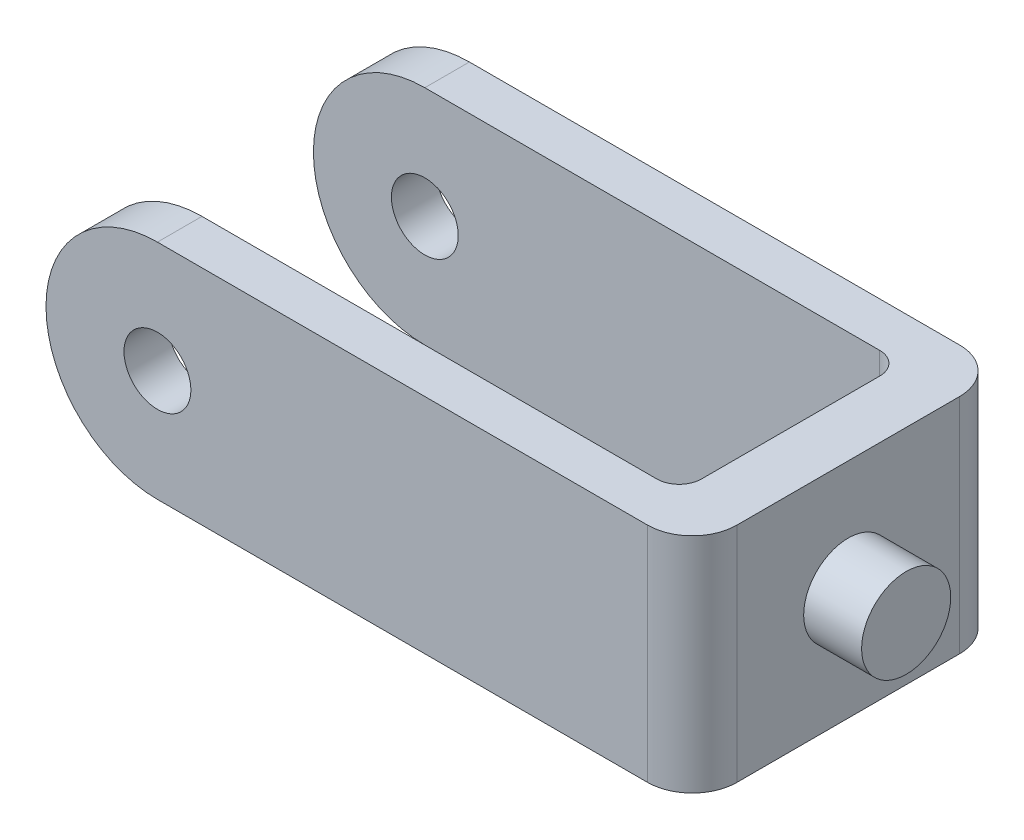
ISO-10303-21;
HEADER;
FILE_DESCRIPTION(('STEP AP214'),'2;1');
FILE_NAME('part.step','',(''),(''),'','','');
FILE_SCHEMA(('AUTOMOTIVE_DESIGN { 1 0 10303 214 1 1 1 1 }'));
ENDSEC;
DATA;
#1=APPLICATION_CONTEXT('core data for automotive mechanical design processes');
#2=APPLICATION_PROTOCOL_DEFINITION('international standard','automotive_design',2000,#1);
#3=PRODUCT_CONTEXT('',#1,'mechanical');
#4=PRODUCT('Part','Part','',(#3));
#5=PRODUCT_RELATED_PRODUCT_CATEGORY('part','',(#4));
#6=PRODUCT_DEFINITION_FORMATION('','',#4);
#7=PRODUCT_DEFINITION_CONTEXT('part definition',#1,'design');
#8=PRODUCT_DEFINITION('design','',#6,#7);
#9=PRODUCT_DEFINITION_SHAPE('','',#8);
#10=(LENGTH_UNIT() NAMED_UNIT(*) SI_UNIT(.MILLI.,.METRE.));
#11=(NAMED_UNIT(*) PLANE_ANGLE_UNIT() SI_UNIT($,.RADIAN.));
#12=(NAMED_UNIT(*) SI_UNIT($,.STERADIAN.) SOLID_ANGLE_UNIT());
#13=UNCERTAINTY_MEASURE_WITH_UNIT(LENGTH_MEASURE(1.E-05),#10,'distance_accuracy_value','');
#14=(GEOMETRIC_REPRESENTATION_CONTEXT(3) GLOBAL_UNCERTAINTY_ASSIGNED_CONTEXT((#13)) GLOBAL_UNIT_ASSIGNED_CONTEXT((#10,
#11,#12)) REPRESENTATION_CONTEXT('',''));
#15=CARTESIAN_POINT('',(0.,0.,0.));
#16=DIRECTION('',(0.,0.,1.));
#17=DIRECTION('',(1.,0.,0.));
#18=AXIS2_PLACEMENT_3D('',#15,#16,#17);
#19=CARTESIAN_POINT('',(74.8577111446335,50.,-40.));
#20=DIRECTION('',(-1.,0.,0.));
#21=DIRECTION('',(0.,0.,1.));
#22=AXIS2_PLACEMENT_3D('',#19,#20,#21);
#23=PLANE('',#22);
#24=DIRECTION('',(0.,0.,-1.));
#25=VECTOR('',#24,1.);
#26=CARTESIAN_POINT('',(74.8577111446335,50.,-40.));
#27=LINE('',#26,#25);
#28=CARTESIAN_POINT('',(74.8577111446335,50.,20.));
#29=VERTEX_POINT('',#28);
#30=CARTESIAN_POINT('',(74.8577111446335,50.,-30.));
#31=VERTEX_POINT('',#30);
#32=EDGE_CURVE('E172',#29,#31,#27,.T.);
#33=ORIENTED_EDGE('',*,*,#32,.F.);
#34=DIRECTION('',(0.,-1.,0.));
#35=VECTOR('',#34,1.);
#36=CARTESIAN_POINT('',(74.8577111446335,50.,20.));
#37=LINE('',#36,#35);
#38=CARTESIAN_POINT('',(74.8577111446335,0.,20.));
#39=VERTEX_POINT('',#38);
#40=EDGE_CURVE('E191',#29,#39,#37,.T.);
#41=ORIENTED_EDGE('',*,*,#40,.T.);
#42=DIRECTION('',(0.,0.,-1.));
#43=VECTOR('',#42,1.);
#44=CARTESIAN_POINT('',(74.8577111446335,0.,-40.));
#45=LINE('',#44,#43);
#46=CARTESIAN_POINT('',(74.8577111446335,0.,-30.));
#47=VERTEX_POINT('',#46);
#48=EDGE_CURVE('E130',#39,#47,#45,.T.);
#49=ORIENTED_EDGE('',*,*,#48,.T.);
#50=DIRECTION('',(0.,-1.,0.));
#51=VECTOR('',#50,1.);
#52=CARTESIAN_POINT('',(74.8577111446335,50.,-30.));
#53=LINE('',#52,#51);
#54=EDGE_CURVE('E177',#47,#31,#53,.F.);
#55=ORIENTED_EDGE('',*,*,#54,.T.);
#56=EDGE_LOOP('',(#33,#41,#49,#55));
#57=FACE_BOUND('',#56,.T.);
#58=CARTESIAN_POINT('',(74.8577111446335,25.,-5.00000000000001));
#59=DIRECTION('',(-1.,0.,0.));
#60=DIRECTION('',(0.,0.,1.));
#61=AXIS2_PLACEMENT_3D('',#58,#59,#60);
#62=CIRCLE('',#61,10.);
#63=CARTESIAN_POINT('',(74.8577111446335,25.,5.));
#64=VERTEX_POINT('',#63);
#65=EDGE_CURVE('E206',#64,#64,#62,.F.);
#66=ORIENTED_EDGE('',*,*,#65,.F.);
#67=EDGE_LOOP('',(#66));
#68=FACE_BOUND('',#67,.T.);
#69=ADVANCED_FACE('F31',(#57,#68),#23,.F.);
#70=CARTESIAN_POINT('',(61.9247651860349,50.,-30.));
#71=DIRECTION('',(0.,0.,-1.));
#72=DIRECTION('',(-1.,0.,0.));
#73=AXIS2_PLACEMENT_3D('',#70,#71,#72);
#74=PLANE('',#73);
#75=CARTESIAN_POINT('',(-45.1422888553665,25.,-30.));
#76=DIRECTION('',(0.,0.,-1.));
#77=DIRECTION('',(-1.,0.,0.));
#78=AXIS2_PLACEMENT_3D('',#75,#76,#77);
#79=CIRCLE('',#78,7.5);
#80=CARTESIAN_POINT('',(-52.6422888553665,25.,-30.));
#81=VERTEX_POINT('',#80);
#82=EDGE_CURVE('E150',#81,#81,#79,.T.);
#83=ORIENTED_EDGE('',*,*,#82,.T.);
#84=EDGE_LOOP('',(#83));
#85=FACE_BOUND('',#84,.T.);
#86=DIRECTION('',(1.,0.,0.));
#87=VECTOR('',#86,1.);
#88=CARTESIAN_POINT('',(61.9247651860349,0.,-30.));
#89=LINE('',#88,#87);
#90=CARTESIAN_POINT('',(-45.1422888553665,0.,-30.));
#91=VERTEX_POINT('',#90);
#92=CARTESIAN_POINT('',(56.9247651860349,0.,-30.));
#93=VERTEX_POINT('',#92);
#94=EDGE_CURVE('E180',#91,#93,#89,.T.);
#95=ORIENTED_EDGE('',*,*,#94,.T.);
#96=DIRECTION('',(0.,-1.,0.));
#97=VECTOR('',#96,1.);
#98=CARTESIAN_POINT('',(56.9247651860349,50.,-30.));
#99=LINE('',#98,#97);
#100=CARTESIAN_POINT('',(56.9247651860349,50.,-30.));
#101=VERTEX_POINT('',#100);
#102=EDGE_CURVE('E214',#93,#101,#99,.F.);
#103=ORIENTED_EDGE('',*,*,#102,.T.);
#104=DIRECTION('',(1.,0.,0.));
#105=VECTOR('',#104,1.);
#106=CARTESIAN_POINT('',(61.9247651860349,50.,-30.));
#107=LINE('',#106,#105);
#108=CARTESIAN_POINT('',(-45.1422888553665,50.,-30.));
#109=VERTEX_POINT('',#108);
#110=EDGE_CURVE('E161',#109,#101,#107,.T.);
#111=ORIENTED_EDGE('',*,*,#110,.F.);
#112=CARTESIAN_POINT('',(-45.1422888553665,25.,-30.));
#113=DIRECTION('',(0.,0.,-1.));
#114=DIRECTION('',(-1.,0.,0.));
#115=AXIS2_PLACEMENT_3D('',#112,#113,#114);
#116=CIRCLE('',#115,25.);
#117=EDGE_CURVE('E148',#91,#109,#116,.T.);
#118=ORIENTED_EDGE('',*,*,#117,.F.);
#119=EDGE_LOOP('',(#95,#103,#111,#118));
#120=FACE_BOUND('',#119,.T.);
#121=ADVANCED_FACE('F252',(#85,#120),#74,.F.);
#122=CARTESIAN_POINT('',(61.9247651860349,50.,-30.));
#123=DIRECTION('',(1.,0.,0.));
#124=DIRECTION('',(0.,0.,-1.));
#125=AXIS2_PLACEMENT_3D('',#122,#123,#124);
#126=PLANE('',#125);
#127=DIRECTION('',(0.,0.,1.));
#128=VECTOR('',#127,1.);
#129=CARTESIAN_POINT('',(61.9247651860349,50.,-30.));
#130=LINE('',#129,#128);
#131=CARTESIAN_POINT('',(61.9247651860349,50.,-25.));
#132=VERTEX_POINT('',#131);
#133=CARTESIAN_POINT('',(61.9247651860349,50.,15.));
#134=VERTEX_POINT('',#133);
#135=EDGE_CURVE('E165',#132,#134,#130,.T.);
#136=ORIENTED_EDGE('',*,*,#135,.F.);
#137=DIRECTION('',(0.,-1.,0.));
#138=VECTOR('',#137,1.);
#139=CARTESIAN_POINT('',(61.9247651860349,0.,-25.));
#140=LINE('',#139,#138);
#141=CARTESIAN_POINT('',(61.9247651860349,0.,-25.));
#142=VERTEX_POINT('',#141);
#143=EDGE_CURVE('E211',#132,#142,#140,.T.);
#144=ORIENTED_EDGE('',*,*,#143,.T.);
#145=DIRECTION('',(0.,0.,1.));
#146=VECTOR('',#145,1.);
#147=CARTESIAN_POINT('',(61.9247651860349,0.,-30.));
#148=LINE('',#147,#146);
#149=CARTESIAN_POINT('',(61.9247651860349,0.,15.));
#150=VERTEX_POINT('',#149);
#151=EDGE_CURVE('E183',#142,#150,#148,.T.);
#152=ORIENTED_EDGE('',*,*,#151,.T.);
#153=DIRECTION('',(0.,-1.,0.));
#154=VECTOR('',#153,1.);
#155=CARTESIAN_POINT('',(61.9247651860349,50.,15.));
#156=LINE('',#155,#154);
#157=EDGE_CURVE('E209',#150,#134,#156,.F.);
#158=ORIENTED_EDGE('',*,*,#157,.T.);
#159=EDGE_LOOP('',(#136,#144,#152,#158));
#160=FACE_BOUND('',#159,.T.);
#161=ADVANCED_FACE('F224',(#160),#126,.F.);
#162=CARTESIAN_POINT('',(61.9247651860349,50.,20.));
#163=DIRECTION('',(0.,0.,1.));
#164=DIRECTION('',(1.,0.,0.));
#165=AXIS2_PLACEMENT_3D('',#162,#163,#164);
#166=PLANE('',#165);
#167=CARTESIAN_POINT('',(-45.1422888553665,25.,20.));
#168=DIRECTION('',(0.,0.,1.));
#169=DIRECTION('',(1.,0.,0.));
#170=AXIS2_PLACEMENT_3D('',#167,#168,#169);
#171=CIRCLE('',#170,7.5);
#172=CARTESIAN_POINT('',(-37.6422888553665,25.,20.));
#173=VERTEX_POINT('',#172);
#174=EDGE_CURVE('E434',#173,#173,#171,.T.);
#175=ORIENTED_EDGE('',*,*,#174,.T.);
#176=EDGE_LOOP('',(#175));
#177=FACE_BOUND('',#176,.T.);
#178=DIRECTION('',(-1.,0.,0.));
#179=VECTOR('',#178,1.);
#180=CARTESIAN_POINT('',(61.9247651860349,50.,20.));
#181=LINE('',#180,#179);
#182=CARTESIAN_POINT('',(56.9247651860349,50.,20.));
#183=VERTEX_POINT('',#182);
#184=CARTESIAN_POINT('',(-45.1422888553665,50.,20.));
#185=VERTEX_POINT('',#184);
#186=EDGE_CURVE('E167',#183,#185,#181,.T.);
#187=ORIENTED_EDGE('',*,*,#186,.F.);
#188=DIRECTION('',(0.,-1.,0.));
#189=VECTOR('',#188,1.);
#190=CARTESIAN_POINT('',(56.9247651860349,0.,20.));
#191=LINE('',#190,#189);
#192=CARTESIAN_POINT('',(56.9247651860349,0.,20.));
#193=VERTEX_POINT('',#192);
#194=EDGE_CURVE('E216',#183,#193,#191,.T.);
#195=ORIENTED_EDGE('',*,*,#194,.T.);
#196=DIRECTION('',(-1.,0.,0.));
#197=VECTOR('',#196,1.);
#198=CARTESIAN_POINT('',(61.9247651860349,0.,20.));
#199=LINE('',#198,#197);
#200=CARTESIAN_POINT('',(-45.1422888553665,0.,20.));
#201=VERTEX_POINT('',#200);
#202=EDGE_CURVE('E139',#193,#201,#199,.T.);
#203=ORIENTED_EDGE('',*,*,#202,.T.);
#204=CARTESIAN_POINT('',(-45.1422888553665,25.,20.));
#205=DIRECTION('',(0.,0.,-1.));
#206=DIRECTION('',(-1.,0.,0.));
#207=AXIS2_PLACEMENT_3D('',#204,#205,#206);
#208=CIRCLE('',#207,25.);
#209=EDGE_CURVE('E138',#201,#185,#208,.T.);
#210=ORIENTED_EDGE('',*,*,#209,.T.);
#211=EDGE_LOOP('',(#187,#195,#203,#210));
#212=FACE_BOUND('',#211,.T.);
#213=ADVANCED_FACE('F227',(#177,#212),#166,.F.);
#214=CARTESIAN_POINT('',(-45.1422888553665,50.,30.));
#215=DIRECTION('',(0.,0.,-1.));
#216=DIRECTION('',(-1.,0.,0.));
#217=AXIS2_PLACEMENT_3D('',#214,#215,#216);
#218=PLANE('',#217);
#219=CARTESIAN_POINT('',(-45.1422888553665,25.,30.));
#220=DIRECTION('',(0.,0.,-1.));
#221=DIRECTION('',(-1.,0.,0.));
#222=AXIS2_PLACEMENT_3D('',#219,#220,#221);
#223=CIRCLE('',#222,7.5);
#224=CARTESIAN_POINT('',(-52.6422888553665,25.,30.));
#225=VERTEX_POINT('',#224);
#226=EDGE_CURVE('E430',#225,#225,#223,.T.);
#227=ORIENTED_EDGE('',*,*,#226,.T.);
#228=EDGE_LOOP('',(#227));
#229=FACE_BOUND('',#228,.T.);
#230=DIRECTION('',(1.,0.,0.));
#231=VECTOR('',#230,1.);
#232=CARTESIAN_POINT('',(-45.1422888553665,50.,30.));
#233=LINE('',#232,#231);
#234=CARTESIAN_POINT('',(-45.1422888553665,50.,30.));
#235=VERTEX_POINT('',#234);
#236=CARTESIAN_POINT('',(64.8577111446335,50.,30.));
#237=VERTEX_POINT('',#236);
#238=EDGE_CURVE('E144',#235,#237,#233,.T.);
#239=ORIENTED_EDGE('',*,*,#238,.F.);
#240=CARTESIAN_POINT('',(-45.1422888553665,25.,30.));
#241=DIRECTION('',(0.,0.,-1.));
#242=DIRECTION('',(-1.,0.,0.));
#243=AXIS2_PLACEMENT_3D('',#240,#241,#242);
#244=CIRCLE('',#243,25.);
#245=CARTESIAN_POINT('',(-45.1422888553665,0.,30.));
#246=VERTEX_POINT('',#245);
#247=EDGE_CURVE('E136',#246,#235,#244,.T.);
#248=ORIENTED_EDGE('',*,*,#247,.F.);
#249=DIRECTION('',(1.,0.,0.));
#250=VECTOR('',#249,1.);
#251=CARTESIAN_POINT('',(-45.1422888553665,0.,30.));
#252=LINE('',#251,#250);
#253=CARTESIAN_POINT('',(64.8577111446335,0.,30.));
#254=VERTEX_POINT('',#253);
#255=EDGE_CURVE('E119',#246,#254,#252,.T.);
#256=ORIENTED_EDGE('',*,*,#255,.T.);
#257=DIRECTION('',(0.,-1.,0.));
#258=VECTOR('',#257,1.);
#259=CARTESIAN_POINT('',(64.8577111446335,50.,30.));
#260=LINE('',#259,#258);
#261=EDGE_CURVE('E197',#254,#237,#260,.F.);
#262=ORIENTED_EDGE('',*,*,#261,.T.);
#263=EDGE_LOOP('',(#239,#248,#256,#262));
#264=FACE_BOUND('',#263,.T.);
#265=ADVANCED_FACE('F142',(#229,#264),#218,.F.);
#266=CARTESIAN_POINT('',(-45.1422888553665,50.,-40.));
#267=DIRECTION('',(0.,0.,1.));
#268=DIRECTION('',(1.,0.,0.));
#269=AXIS2_PLACEMENT_3D('',#266,#267,#268);
#270=PLANE('',#269);
#271=CARTESIAN_POINT('',(-45.1422888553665,25.,-40.));
#272=DIRECTION('',(0.,0.,-1.));
#273=DIRECTION('',(-1.,0.,0.));
#274=AXIS2_PLACEMENT_3D('',#271,#272,#273);
#275=CIRCLE('',#274,7.5);
#276=CARTESIAN_POINT('',(-52.6422888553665,25.,-40.));
#277=VERTEX_POINT('',#276);
#278=EDGE_CURVE('E427',#277,#277,#275,.T.);
#279=ORIENTED_EDGE('',*,*,#278,.F.);
#280=EDGE_LOOP('',(#279));
#281=FACE_BOUND('',#280,.T.);
#282=DIRECTION('',(-1.,0.,0.));
#283=VECTOR('',#282,1.);
#284=CARTESIAN_POINT('',(-45.1422888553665,0.,-40.));
#285=LINE('',#284,#283);
#286=CARTESIAN_POINT('',(64.8577111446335,0.,-40.));
#287=VERTEX_POINT('',#286);
#288=CARTESIAN_POINT('',(-45.1422888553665,0.,-40.));
#289=VERTEX_POINT('',#288);
#290=EDGE_CURVE('E162',#287,#289,#285,.T.);
#291=ORIENTED_EDGE('',*,*,#290,.T.);
#292=CARTESIAN_POINT('',(-45.1422888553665,25.,-40.));
#293=DIRECTION('',(0.,0.,-1.));
#294=DIRECTION('',(-1.,0.,0.));
#295=AXIS2_PLACEMENT_3D('',#292,#293,#294);
#296=CIRCLE('',#295,25.);
#297=CARTESIAN_POINT('',(-45.1422888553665,50.,-40.));
#298=VERTEX_POINT('',#297);
#299=EDGE_CURVE('E145',#289,#298,#296,.T.);
#300=ORIENTED_EDGE('',*,*,#299,.T.);
#301=DIRECTION('',(-1.,0.,0.));
#302=VECTOR('',#301,1.);
#303=CARTESIAN_POINT('',(-45.1422888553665,50.,-40.));
#304=LINE('',#303,#302);
#305=CARTESIAN_POINT('',(64.8577111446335,50.,-40.));
#306=VERTEX_POINT('',#305);
#307=EDGE_CURVE('E175',#306,#298,#304,.T.);
#308=ORIENTED_EDGE('',*,*,#307,.F.);
#309=DIRECTION('',(0.,-1.,0.));
#310=VECTOR('',#309,1.);
#311=CARTESIAN_POINT('',(64.8577111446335,50.,-40.));
#312=LINE('',#311,#310);
#313=EDGE_CURVE('E203',#306,#287,#312,.T.);
#314=ORIENTED_EDGE('',*,*,#313,.T.);
#315=EDGE_LOOP('',(#291,#300,#308,#314));
#316=FACE_BOUND('',#315,.T.);
#317=ADVANCED_FACE('F245',(#281,#316),#270,.F.);
#318=CARTESIAN_POINT('',(-45.1422888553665,50.,-30.));
#319=DIRECTION('',(0.,-1.,0.));
#320=DIRECTION('',(0.,0.,-1.));
#321=AXIS2_PLACEMENT_3D('',#318,#319,#320);
#322=PLANE('',#321);
#323=ORIENTED_EDGE('',*,*,#238,.T.);
#324=CARTESIAN_POINT('',(64.8577111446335,50.,20.));
#325=DIRECTION('',(0.,-1.,0.));
#326=DIRECTION('',(0.,0.,-1.));
#327=AXIS2_PLACEMENT_3D('',#324,#325,#326);
#328=CIRCLE('',#327,10.);
#329=EDGE_CURVE('E201',#237,#29,#328,.F.);
#330=ORIENTED_EDGE('',*,*,#329,.T.);
#331=ORIENTED_EDGE('',*,*,#32,.T.);
#332=CARTESIAN_POINT('',(64.8577111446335,50.,-30.));
#333=DIRECTION('',(0.,-1.,0.));
#334=DIRECTION('',(0.,0.,-1.));
#335=AXIS2_PLACEMENT_3D('',#332,#333,#334);
#336=CIRCLE('',#335,10.);
#337=EDGE_CURVE('E199',#31,#306,#336,.F.);
#338=ORIENTED_EDGE('',*,*,#337,.T.);
#339=ORIENTED_EDGE('',*,*,#307,.T.);
#340=DIRECTION('',(0.,0.,1.));
#341=VECTOR('',#340,1.);
#342=CARTESIAN_POINT('',(-45.1422888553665,50.,-40.));
#343=LINE('',#342,#341);
#344=EDGE_CURVE('E158',#298,#109,#343,.T.);
#345=ORIENTED_EDGE('',*,*,#344,.T.);
#346=ORIENTED_EDGE('',*,*,#110,.T.);
#347=CARTESIAN_POINT('',(56.9247651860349,50.,-25.));
#348=DIRECTION('',(0.,-1.,0.));
#349=DIRECTION('',(0.,0.,-1.));
#350=AXIS2_PLACEMENT_3D('',#347,#348,#349);
#351=CIRCLE('',#350,5.);
#352=EDGE_CURVE('E220',#101,#132,#351,.T.);
#353=ORIENTED_EDGE('',*,*,#352,.T.);
#354=ORIENTED_EDGE('',*,*,#135,.T.);
#355=CARTESIAN_POINT('',(56.9247651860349,50.,15.));
#356=DIRECTION('',(0.,-1.,0.));
#357=DIRECTION('',(0.,0.,-1.));
#358=AXIS2_PLACEMENT_3D('',#355,#356,#357);
#359=CIRCLE('',#358,5.);
#360=EDGE_CURVE('E11',#134,#183,#359,.T.);
#361=ORIENTED_EDGE('',*,*,#360,.T.);
#362=ORIENTED_EDGE('',*,*,#186,.T.);
#363=DIRECTION('',(0.,0.,1.));
#364=VECTOR('',#363,1.);
#365=CARTESIAN_POINT('',(-45.1422888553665,50.,20.));
#366=LINE('',#365,#364);
#367=EDGE_CURVE('E169',#185,#235,#366,.T.);
#368=ORIENTED_EDGE('',*,*,#367,.T.);
#369=EDGE_LOOP('',(#323,#330,#331,#338,#339,#345,#346,#353,#354,#361,#362,#368));
#370=FACE_BOUND('',#369,.T.);
#371=ADVANCED_FACE('F228',(#370),#322,.F.);
#372=CARTESIAN_POINT('',(-45.1422888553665,0.,-30.));
#373=DIRECTION('',(0.,-1.,0.));
#374=DIRECTION('',(0.,0.,-1.));
#375=AXIS2_PLACEMENT_3D('',#372,#373,#374);
#376=PLANE('',#375);
#377=ORIENTED_EDGE('',*,*,#48,.F.);
#378=CARTESIAN_POINT('',(64.8577111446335,0.,20.));
#379=DIRECTION('',(0.,-1.,0.));
#380=DIRECTION('',(0.,0.,-1.));
#381=AXIS2_PLACEMENT_3D('',#378,#379,#380);
#382=CIRCLE('',#381,10.);
#383=EDGE_CURVE('E126',#39,#254,#382,.T.);
#384=ORIENTED_EDGE('',*,*,#383,.T.);
#385=ORIENTED_EDGE('',*,*,#255,.F.);
#386=DIRECTION('',(0.,0.,1.));
#387=VECTOR('',#386,1.);
#388=CARTESIAN_POINT('',(-45.1422888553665,0.,20.));
#389=LINE('',#388,#387);
#390=EDGE_CURVE('E124',#201,#246,#389,.T.);
#391=ORIENTED_EDGE('',*,*,#390,.F.);
#392=ORIENTED_EDGE('',*,*,#202,.F.);
#393=CARTESIAN_POINT('',(56.9247651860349,0.,15.));
#394=DIRECTION('',(0.,-1.,0.));
#395=DIRECTION('',(0.,0.,-1.));
#396=AXIS2_PLACEMENT_3D('',#393,#394,#395);
#397=CIRCLE('',#396,5.);
#398=EDGE_CURVE('E39',#193,#150,#397,.F.);
#399=ORIENTED_EDGE('',*,*,#398,.T.);
#400=ORIENTED_EDGE('',*,*,#151,.F.);
#401=CARTESIAN_POINT('',(56.9247651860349,0.,-25.));
#402=DIRECTION('',(0.,-1.,0.));
#403=DIRECTION('',(0.,0.,-1.));
#404=AXIS2_PLACEMENT_3D('',#401,#402,#403);
#405=CIRCLE('',#404,5.);
#406=EDGE_CURVE('E218',#142,#93,#405,.F.);
#407=ORIENTED_EDGE('',*,*,#406,.T.);
#408=ORIENTED_EDGE('',*,*,#94,.F.);
#409=DIRECTION('',(0.,0.,1.));
#410=VECTOR('',#409,1.);
#411=CARTESIAN_POINT('',(-45.1422888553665,0.,-40.));
#412=LINE('',#411,#410);
#413=EDGE_CURVE('E156',#289,#91,#412,.T.);
#414=ORIENTED_EDGE('',*,*,#413,.F.);
#415=ORIENTED_EDGE('',*,*,#290,.F.);
#416=CARTESIAN_POINT('',(64.8577111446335,0.,-30.));
#417=DIRECTION('',(0.,-1.,0.));
#418=DIRECTION('',(0.,0.,-1.));
#419=AXIS2_PLACEMENT_3D('',#416,#417,#418);
#420=CIRCLE('',#419,10.);
#421=EDGE_CURVE('E194',#287,#47,#420,.T.);
#422=ORIENTED_EDGE('',*,*,#421,.T.);
#423=EDGE_LOOP('',(#377,#384,#385,#391,#392,#399,#400,#407,#408,#414,#415,#422));
#424=FACE_BOUND('',#423,.T.);
#425=ADVANCED_FACE('F122',(#424),#376,.T.);
#426=CARTESIAN_POINT('',(64.8577111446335,50.,20.));
#427=DIRECTION('',(0.,-1.,0.));
#428=DIRECTION('',(0.,0.,-1.));
#429=AXIS2_PLACEMENT_3D('',#426,#427,#428);
#430=CYLINDRICAL_SURFACE('',#429,10.);
#431=ORIENTED_EDGE('',*,*,#329,.F.);
#432=ORIENTED_EDGE('',*,*,#261,.F.);
#433=ORIENTED_EDGE('',*,*,#383,.F.);
#434=ORIENTED_EDGE('',*,*,#40,.F.);
#435=EDGE_LOOP('',(#431,#432,#433,#434));
#436=FACE_BOUND('',#435,.T.);
#437=ADVANCED_FACE('F233',(#436),#430,.T.);
#438=CARTESIAN_POINT('',(64.8577111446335,50.,-30.));
#439=DIRECTION('',(0.,-1.,0.));
#440=DIRECTION('',(0.,0.,-1.));
#441=AXIS2_PLACEMENT_3D('',#438,#439,#440);
#442=CYLINDRICAL_SURFACE('',#441,10.);
#443=ORIENTED_EDGE('',*,*,#337,.F.);
#444=ORIENTED_EDGE('',*,*,#54,.F.);
#445=ORIENTED_EDGE('',*,*,#421,.F.);
#446=ORIENTED_EDGE('',*,*,#313,.F.);
#447=EDGE_LOOP('',(#443,#444,#445,#446));
#448=FACE_BOUND('',#447,.T.);
#449=ADVANCED_FACE('F242',(#448),#442,.T.);
#450=CARTESIAN_POINT('',(-45.1422888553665,25.,-30.));
#451=DIRECTION('',(0.,0.,-1.));
#452=DIRECTION('',(-1.,0.,0.));
#453=AXIS2_PLACEMENT_3D('',#450,#451,#452);
#454=CYLINDRICAL_SURFACE('',#453,25.);
#455=ORIENTED_EDGE('',*,*,#117,.T.);
#456=ORIENTED_EDGE('',*,*,#344,.F.);
#457=ORIENTED_EDGE('',*,*,#299,.F.);
#458=ORIENTED_EDGE('',*,*,#413,.T.);
#459=EDGE_LOOP('',(#455,#456,#457,#458));
#460=FACE_BOUND('',#459,.T.);
#461=ADVANCED_FACE('F249',(#460),#454,.T.);
#462=CARTESIAN_POINT('',(-45.1422888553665,25.,30.));
#463=DIRECTION('',(0.,0.,-1.));
#464=DIRECTION('',(-1.,0.,0.));
#465=AXIS2_PLACEMENT_3D('',#462,#463,#464);
#466=CYLINDRICAL_SURFACE('',#465,25.);
#467=ORIENTED_EDGE('',*,*,#247,.T.);
#468=ORIENTED_EDGE('',*,*,#367,.F.);
#469=ORIENTED_EDGE('',*,*,#209,.F.);
#470=ORIENTED_EDGE('',*,*,#390,.T.);
#471=EDGE_LOOP('',(#467,#468,#469,#470));
#472=FACE_BOUND('',#471,.T.);
#473=ADVANCED_FACE('F134',(#472),#466,.T.);
#474=CARTESIAN_POINT('',(-45.1422888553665,25.,30.));
#475=DIRECTION('',(0.,0.,-1.));
#476=DIRECTION('',(-1.,0.,0.));
#477=AXIS2_PLACEMENT_3D('',#474,#475,#476);
#478=CYLINDRICAL_SURFACE('',#477,7.5);
#479=ORIENTED_EDGE('',*,*,#278,.T.);
#480=EDGE_LOOP('',(#479));
#481=FACE_BOUND('',#480,.T.);
#482=ORIENTED_EDGE('',*,*,#82,.F.);
#483=EDGE_LOOP('',(#482));
#484=FACE_BOUND('',#483,.T.);
#485=ADVANCED_FACE('F294',(#481,#484),#478,.F.);
#486=ORIENTED_EDGE('',*,*,#226,.F.);
#487=EDGE_LOOP('',(#486));
#488=FACE_BOUND('',#487,.T.);
#489=ORIENTED_EDGE('',*,*,#174,.F.);
#490=EDGE_LOOP('',(#489));
#491=FACE_BOUND('',#490,.T.);
#492=ADVANCED_FACE('F349',(#488,#491),#478,.F.);
#493=CARTESIAN_POINT('',(87.8577111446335,25.,-5.00000000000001));
#494=DIRECTION('',(-1.,0.,0.));
#495=DIRECTION('',(0.,0.,1.));
#496=AXIS2_PLACEMENT_3D('',#493,#494,#495);
#497=CYLINDRICAL_SURFACE('',#496,10.);
#498=CARTESIAN_POINT('',(87.8577111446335,25.,-5.00000000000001));
#499=DIRECTION('',(1.,0.,0.));
#500=DIRECTION('',(0.,0.,-1.));
#501=AXIS2_PLACEMENT_3D('',#498,#499,#500);
#502=CIRCLE('',#501,10.);
#503=CARTESIAN_POINT('',(87.8577111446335,25.,-15.));
#504=VERTEX_POINT('',#503);
#505=EDGE_CURVE('E425',#504,#504,#502,.T.);
#506=ORIENTED_EDGE('',*,*,#505,.F.);
#507=EDGE_LOOP('',(#506));
#508=FACE_BOUND('',#507,.T.);
#509=ORIENTED_EDGE('',*,*,#65,.T.);
#510=EDGE_LOOP('',(#509));
#511=FACE_BOUND('',#510,.T.);
#512=ADVANCED_FACE('F263',(#508,#511),#497,.T.);
#513=CARTESIAN_POINT('',(87.8577111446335,25.,-5.00000000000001));
#514=DIRECTION('',(1.,0.,0.));
#515=DIRECTION('',(0.,0.,-1.));
#516=AXIS2_PLACEMENT_3D('',#513,#514,#515);
#517=PLANE('',#516);
#518=ORIENTED_EDGE('',*,*,#505,.T.);
#519=EDGE_LOOP('',(#518));
#520=FACE_BOUND('',#519,.T.);
#521=ADVANCED_FACE('F258',(#520),#517,.T.);
#522=CARTESIAN_POINT('',(56.9247651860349,50.,-25.));
#523=DIRECTION('',(0.,1.,0.));
#524=DIRECTION('',(0.,0.,1.));
#525=AXIS2_PLACEMENT_3D('',#522,#523,#524);
#526=CYLINDRICAL_SURFACE('',#525,5.);
#527=ORIENTED_EDGE('',*,*,#352,.F.);
#528=ORIENTED_EDGE('',*,*,#102,.F.);
#529=ORIENTED_EDGE('',*,*,#406,.F.);
#530=ORIENTED_EDGE('',*,*,#143,.F.);
#531=EDGE_LOOP('',(#527,#528,#529,#530));
#532=FACE_BOUND('',#531,.T.);
#533=ADVANCED_FACE('F256',(#532),#526,.F.);
#534=CARTESIAN_POINT('',(56.9247651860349,50.,15.));
#535=DIRECTION('',(0.,1.,0.));
#536=DIRECTION('',(0.,0.,1.));
#537=AXIS2_PLACEMENT_3D('',#534,#535,#536);
#538=CYLINDRICAL_SURFACE('',#537,5.);
#539=ORIENTED_EDGE('',*,*,#360,.F.);
#540=ORIENTED_EDGE('',*,*,#157,.F.);
#541=ORIENTED_EDGE('',*,*,#398,.F.);
#542=ORIENTED_EDGE('',*,*,#194,.F.);
#543=EDGE_LOOP('',(#539,#540,#541,#542));
#544=FACE_BOUND('',#543,.T.);
#545=ADVANCED_FACE('F33',(#544),#538,.F.);
#546=CLOSED_SHELL('',(#69,#121,#161,#213,#265,#317,#371,#425,#437,#449,#461,#473,#485,#492,#512,
#521,#533,#545));
#547=MANIFOLD_SOLID_BREP('B2',#546);
#548=ADVANCED_BREP_SHAPE_REPRESENTATION('',(#18,#547),#14);
#549=SHAPE_DEFINITION_REPRESENTATION(#9,#548);
ENDSEC;
END-ISO-10303-21;
